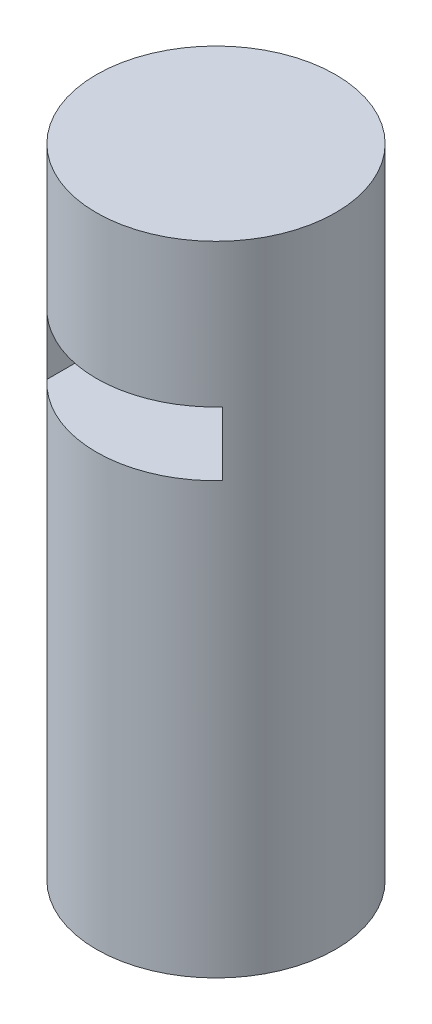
ISO-10303-21;
HEADER;
FILE_DESCRIPTION(('STEP AP214'),'2;1');
FILE_NAME('part.step','',(''),(''),'','','');
FILE_SCHEMA(('AUTOMOTIVE_DESIGN { 1 0 10303 214 1 1 1 1 }'));
ENDSEC;
DATA;
#1=APPLICATION_CONTEXT('core data for automotive mechanical design processes');
#2=APPLICATION_PROTOCOL_DEFINITION('international standard','automotive_design',2000,#1);
#3=PRODUCT_CONTEXT('',#1,'mechanical');
#4=PRODUCT('Part','Part','',(#3));
#5=PRODUCT_RELATED_PRODUCT_CATEGORY('part','',(#4));
#6=PRODUCT_DEFINITION_FORMATION('','',#4);
#7=PRODUCT_DEFINITION_CONTEXT('part definition',#1,'design');
#8=PRODUCT_DEFINITION('design','',#6,#7);
#9=PRODUCT_DEFINITION_SHAPE('','',#8);
#10=(LENGTH_UNIT() NAMED_UNIT(*) SI_UNIT(.MILLI.,.METRE.));
#11=(NAMED_UNIT(*) PLANE_ANGLE_UNIT() SI_UNIT($,.RADIAN.));
#12=(NAMED_UNIT(*) SI_UNIT($,.STERADIAN.) SOLID_ANGLE_UNIT());
#13=UNCERTAINTY_MEASURE_WITH_UNIT(LENGTH_MEASURE(1.E-05),#10,'distance_accuracy_value','');
#14=(GEOMETRIC_REPRESENTATION_CONTEXT(3) GLOBAL_UNCERTAINTY_ASSIGNED_CONTEXT((#13)) GLOBAL_UNIT_ASSIGNED_CONTEXT((#10,
#11,#12)) REPRESENTATION_CONTEXT('',''));
#15=CARTESIAN_POINT('',(0.,0.,0.));
#16=DIRECTION('',(0.,0.,1.));
#17=DIRECTION('',(1.,0.,0.));
#18=AXIS2_PLACEMENT_3D('',#15,#16,#17);
#19=CARTESIAN_POINT('',(-14.2270938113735,39.37,3.8581949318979));
#20=DIRECTION('',(0.,-1.,0.));
#21=DIRECTION('',(0.,0.,-1.));
#22=AXIS2_PLACEMENT_3D('',#19,#20,#21);
#23=CYLINDRICAL_SURFACE('',#22,9.525);
#24=DIRECTION('',(0.,-1.,0.));
#25=VECTOR('',#24,1.);
#26=CARTESIAN_POINT('',(-21.2120938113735,39.37,10.3339497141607));
#27=LINE('',#26,#25);
#28=CARTESIAN_POINT('',(-21.2120938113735,34.29,10.3339497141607));
#29=VERTEX_POINT('',#28);
#30=CARTESIAN_POINT('',(-21.2120938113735,39.37,10.3339497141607));
#31=VERTEX_POINT('',#30);
#32=EDGE_CURVE('E51',#29,#31,#27,.F.);
#33=ORIENTED_EDGE('',*,*,#32,.T.);
#34=CARTESIAN_POINT('',(-14.2270938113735,39.37,3.8581949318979));
#35=DIRECTION('',(0.,1.,0.));
#36=DIRECTION('',(0.,0.,1.));
#37=AXIS2_PLACEMENT_3D('',#34,#35,#36);
#38=CIRCLE('',#37,9.525);
#39=CARTESIAN_POINT('',(-7.24209381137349,39.37,10.3339497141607));
#40=VERTEX_POINT('',#39);
#41=EDGE_CURVE('E79',#31,#40,#38,.T.);
#42=ORIENTED_EDGE('',*,*,#41,.T.);
#43=DIRECTION('',(0.,-1.,0.));
#44=VECTOR('',#43,1.);
#45=CARTESIAN_POINT('',(-7.24209381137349,39.37,10.3339497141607));
#46=LINE('',#45,#44);
#47=CARTESIAN_POINT('',(-7.24209381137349,34.29,10.3339497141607));
#48=VERTEX_POINT('',#47);
#49=EDGE_CURVE('E92',#40,#48,#46,.T.);
#50=ORIENTED_EDGE('',*,*,#49,.T.);
#51=CARTESIAN_POINT('',(-14.2270938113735,34.29,3.8581949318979));
#52=DIRECTION('',(0.,1.,0.));
#53=DIRECTION('',(0.,0.,1.));
#54=AXIS2_PLACEMENT_3D('',#51,#52,#53);
#55=CIRCLE('',#54,9.525);
#56=EDGE_CURVE('E40',#29,#48,#55,.T.);
#57=ORIENTED_EDGE('',*,*,#56,.F.);
#58=EDGE_LOOP('',(#33,#42,#50,#57));
#59=FACE_BOUND('',#58,.T.);
#60=CARTESIAN_POINT('',(-7.24209381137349,39.37,-2.61755985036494));
#61=VERTEX_POINT('',#60);
#62=CARTESIAN_POINT('',(-21.2120938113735,39.37,-2.61755985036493));
#63=VERTEX_POINT('',#62);
#64=EDGE_CURVE('E81',#61,#63,#38,.T.);
#65=ORIENTED_EDGE('',*,*,#64,.T.);
#66=DIRECTION('',(0.,-1.,0.));
#67=VECTOR('',#66,1.);
#68=CARTESIAN_POINT('',(-21.2120938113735,39.37,-2.61755985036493));
#69=LINE('',#68,#67);
#70=CARTESIAN_POINT('',(-21.2120938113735,34.29,-2.61755985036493));
#71=VERTEX_POINT('',#70);
#72=EDGE_CURVE('E99',#63,#71,#69,.T.);
#73=ORIENTED_EDGE('',*,*,#72,.T.);
#74=CARTESIAN_POINT('',(-7.24209381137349,34.29,-2.61755985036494));
#75=VERTEX_POINT('',#74);
#76=EDGE_CURVE('E11',#75,#71,#55,.T.);
#77=ORIENTED_EDGE('',*,*,#76,.F.);
#78=DIRECTION('',(0.,-1.,0.));
#79=VECTOR('',#78,1.);
#80=CARTESIAN_POINT('',(-7.24209381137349,39.37,-2.61755985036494));
#81=LINE('',#80,#79);
#82=EDGE_CURVE('E97',#75,#61,#81,.F.);
#83=ORIENTED_EDGE('',*,*,#82,.T.);
#84=EDGE_LOOP('',(#65,#73,#77,#83));
#85=FACE_BOUND('',#84,.T.);
#86=CARTESIAN_POINT('',(-14.2270938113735,0.,3.8581949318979));
#87=DIRECTION('',(0.,1.,0.));
#88=DIRECTION('',(0.,0.,1.));
#89=AXIS2_PLACEMENT_3D('',#86,#87,#88);
#90=CIRCLE('',#89,9.525);
#91=CARTESIAN_POINT('',(-14.2270938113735,0.,13.3831949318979));
#92=VERTEX_POINT('',#91);
#93=EDGE_CURVE('E86',#92,#92,#90,.T.);
#94=ORIENTED_EDGE('',*,*,#93,.T.);
#95=EDGE_LOOP('',(#94));
#96=FACE_BOUND('',#95,.T.);
#97=CARTESIAN_POINT('',(-14.2270938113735,50.8,3.8581949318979));
#98=DIRECTION('',(0.,1.,0.));
#99=DIRECTION('',(0.,0.,1.));
#100=AXIS2_PLACEMENT_3D('',#97,#98,#99);
#101=CIRCLE('',#100,9.525);
#102=CARTESIAN_POINT('',(-14.2270938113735,50.8,13.3831949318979));
#103=VERTEX_POINT('',#102);
#104=EDGE_CURVE('E110',#103,#103,#101,.T.);
#105=ORIENTED_EDGE('',*,*,#104,.F.);
#106=EDGE_LOOP('',(#105));
#107=FACE_BOUND('',#106,.T.);
#108=ADVANCED_FACE('F37',(#59,#85,#96,#107),#23,.T.);
#109=CARTESIAN_POINT('',(-14.2270938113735,0.,3.8581949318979));
#110=DIRECTION('',(0.,1.,0.));
#111=DIRECTION('',(0.,0.,1.));
#112=AXIS2_PLACEMENT_3D('',#109,#110,#111);
#113=PLANE('',#112);
#114=ORIENTED_EDGE('',*,*,#93,.F.);
#115=EDGE_LOOP('',(#114));
#116=FACE_BOUND('',#115,.T.);
#117=ADVANCED_FACE('F125',(#116),#113,.F.);
#118=CARTESIAN_POINT('',(0.,34.29,0.));
#119=DIRECTION('',(0.,1.,0.));
#120=DIRECTION('',(0.,0.,1.));
#121=AXIS2_PLACEMENT_3D('',#118,#119,#120);
#122=PLANE('',#121);
#123=ORIENTED_EDGE('',*,*,#76,.T.);
#124=DIRECTION('',(0.,0.,1.));
#125=VECTOR('',#124,1.);
#126=CARTESIAN_POINT('',(-21.2120938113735,34.29,-6.3018050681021));
#127=LINE('',#126,#125);
#128=EDGE_CURVE('E109',#71,#29,#127,.T.);
#129=ORIENTED_EDGE('',*,*,#128,.T.);
#130=ORIENTED_EDGE('',*,*,#56,.T.);
#131=DIRECTION('',(0.,0.,-1.));
#132=VECTOR('',#131,1.);
#133=CARTESIAN_POINT('',(-7.24209381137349,34.29,-6.3018050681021));
#134=LINE('',#133,#132);
#135=EDGE_CURVE('E96',#48,#75,#134,.T.);
#136=ORIENTED_EDGE('',*,*,#135,.T.);
#137=EDGE_LOOP('',(#123,#129,#130,#136));
#138=FACE_BOUND('',#137,.T.);
#139=ADVANCED_FACE('F108',(#138),#122,.T.);
#140=CARTESIAN_POINT('',(-21.2120938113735,34.29,-6.3018050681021));
#141=DIRECTION('',(-1.,0.,0.));
#142=DIRECTION('',(0.,0.,1.));
#143=AXIS2_PLACEMENT_3D('',#140,#141,#142);
#144=PLANE('',#143);
#145=DIRECTION('',(0.,0.,1.));
#146=VECTOR('',#145,1.);
#147=CARTESIAN_POINT('',(-21.2120938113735,39.37,3.8581949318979));
#148=LINE('',#147,#146);
#149=EDGE_CURVE('E85',#63,#31,#148,.T.);
#150=ORIENTED_EDGE('',*,*,#149,.T.);
#151=ORIENTED_EDGE('',*,*,#32,.F.);
#152=ORIENTED_EDGE('',*,*,#128,.F.);
#153=ORIENTED_EDGE('',*,*,#72,.F.);
#154=EDGE_LOOP('',(#150,#151,#152,#153));
#155=FACE_BOUND('',#154,.T.);
#156=ADVANCED_FACE('F117',(#155),#144,.F.);
#157=CARTESIAN_POINT('',(-7.24209381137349,34.29,-6.3018050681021));
#158=DIRECTION('',(1.,0.,0.));
#159=DIRECTION('',(0.,0.,-1.));
#160=AXIS2_PLACEMENT_3D('',#157,#158,#159);
#161=PLANE('',#160);
#162=DIRECTION('',(0.,0.,-1.));
#163=VECTOR('',#162,1.);
#164=CARTESIAN_POINT('',(-7.24209381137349,39.37,3.8581949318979));
#165=LINE('',#164,#163);
#166=EDGE_CURVE('E76',#40,#61,#165,.T.);
#167=ORIENTED_EDGE('',*,*,#166,.T.);
#168=ORIENTED_EDGE('',*,*,#82,.F.);
#169=ORIENTED_EDGE('',*,*,#135,.F.);
#170=ORIENTED_EDGE('',*,*,#49,.F.);
#171=EDGE_LOOP('',(#167,#168,#169,#170));
#172=FACE_BOUND('',#171,.T.);
#173=ADVANCED_FACE('F95',(#172),#161,.F.);
#174=CARTESIAN_POINT('',(-14.2270938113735,39.37,3.8581949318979));
#175=DIRECTION('',(0.,1.,0.));
#176=DIRECTION('',(0.,0.,1.));
#177=AXIS2_PLACEMENT_3D('',#174,#175,#176);
#178=PLANE('',#177);
#179=ORIENTED_EDGE('',*,*,#41,.F.);
#180=ORIENTED_EDGE('',*,*,#149,.F.);
#181=ORIENTED_EDGE('',*,*,#64,.F.);
#182=ORIENTED_EDGE('',*,*,#166,.F.);
#183=EDGE_LOOP('',(#179,#180,#181,#182));
#184=FACE_BOUND('',#183,.T.);
#185=ADVANCED_FACE('F78',(#184),#178,.F.);
#186=CARTESIAN_POINT('',(-14.2270938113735,50.8,3.8581949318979));
#187=DIRECTION('',(0.,1.,0.));
#188=DIRECTION('',(0.,0.,1.));
#189=AXIS2_PLACEMENT_3D('',#186,#187,#188);
#190=PLANE('',#189);
#191=ORIENTED_EDGE('',*,*,#104,.T.);
#192=EDGE_LOOP('',(#191));
#193=FACE_BOUND('',#192,.T.);
#194=ADVANCED_FACE('F164',(#193),#190,.T.);
#195=CLOSED_SHELL('',(#108,#117,#139,#156,#173,#185,#194));
#196=MANIFOLD_SOLID_BREP('B2',#195);
#197=ADVANCED_BREP_SHAPE_REPRESENTATION('',(#18,#196),#14);
#198=SHAPE_DEFINITION_REPRESENTATION(#9,#197);
ENDSEC;
END-ISO-10303-21;
